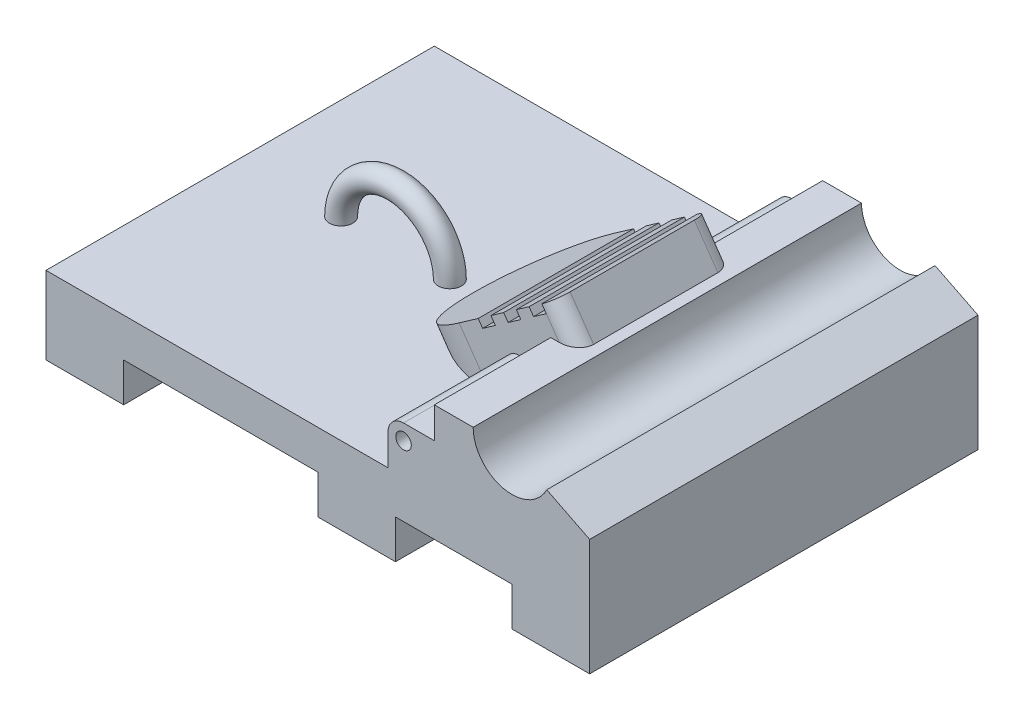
from build123d import *

# Parameters (mm, degrees)
BOSS_EXTRUDE1_DEPTH     = 63.5
FILLET1_R               = 5.08
BOSS_EXTRUDE2_REACH     = 121.09
FILLET2_R               = 5.08
SKETCH5_W               = 5.08
SKETCH5_H               = 50.8
CUT_EXTRUDE1_DEPTH      = 2.54
SWEEP1_PROFILE_R        = 3.81
BOSS_EXTRUDE3_REACH     = 175.993
SKETCH17_R              = 2.54
CUT_EXTRUDE2_DEPTH      = 174.992909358
CUT_EXTRUDE2_DEPTH_BACK = 174.992909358


with BuildPart() as part:
    # Sketch2 → Boss-Extrude1 (new, symmetric)
    with BuildSketch(Plane.XY):
        Polygon((12.7, 0), (-12.7, 0), (-12.7, 12.7), (-76.2, 12.7), (-76.2, 0), (-101.6, 0), (-101.6, 25.4), (25.4, 25.4), (25.4, 50.8), (50.8, 50.8), (76.2, 38.1), (76.2, 0), (50.8, 0), (50.8, 12.7), (12.7, 12.7), align=None)
    extrude(amount=BOSS_EXTRUDE1_DEPTH, both=True)

    # Fillet1
    fillet1_edges = [part.edges().sort_by_distance(p)[0] for p in [
        (25.4, 25.4, 0),
    ]]
    fillet(fillet1_edges, radius=FILLET1_R)

    # Sketch4 → Boss-Extrude2 (add, up to next)
    with BuildSketch(Plane(origin=(-20.290440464, 28.977752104, 0), x_dir=(0, 0, 1), z_dir=(-0.5735764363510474, 0.819152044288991, 0)), mode=Mode.PRIVATE) as boss_extrude2_sk1:
        with BuildLine():
            Line((-25.4, 19.162379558), (-25.4, 57.262379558))
            Line((-25.4, 57.262379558), (25.4, 57.262379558))
            Line((25.4, 57.262379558), (25.4, 19.162379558))
            ThreePointArc((25.4, 19.162379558), (0, -6.237620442), (-25.4, 19.162379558))
        make_face()
    boss_extrude2_tool1 = extrude(boss_extrude2_sk1.sketch, amount=-BOSS_EXTRUDE2_REACH, mode=Mode.PRIVATE) - part.part
    add(boss_extrude2_tool1.solids().sort_by_distance((2.613864, 45.015518, 0))[0])

    # Fillet2
    fillet2_edges = [part.edges().sort_by_distance(p)[0] for p in [
        (30.475034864, 56.311051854, 25.4),
        (30.475034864, 56.311051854, -25.4),
    ]]
    fillet(fillet2_edges, radius=FILLET2_R)

    # Sketch5 → Cut-Extrude1 (cut)
    with BuildSketch(Plane(origin=(-20.290440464, 28.977752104, 0), x_dir=(0.8191520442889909, 0.5735764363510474, 0), z_dir=(-0.5735764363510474, 0.8191520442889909, 0))):
        with Locations((49.642379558, 0)):
            Rectangle(SKETCH5_W, SKETCH5_H)
        with Locations((39.482379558, 0)):
            Rectangle(SKETCH5_W, SKETCH5_H)
        with Locations((29.322379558, 0)):
            Rectangle(SKETCH5_W, SKETCH5_H)
    extrude(amount=-CUT_EXTRUDE1_DEPTH, mode=Mode.SUBTRACT)

    # Sweep1: sweep along a path in Sketch6
    with BuildLine(Plane.XY) as sweep1_path:
        ThreePointArc((-68.58, 25.4), (-50.8, 43.18), (-33.02, 25.4))
    # Sweep1 profile (on start of the path) → Sweep1 (sweep)
    with BuildSketch(Plane(origin=(-68.58, 25.4, 0), x_dir=(1, 0, 0), z_dir=(0, 1, 0))):
        Circle(SWEEP1_PROFILE_R)
    sweep(path=sweep1_path.line)

    # Boss-Extrude3: up to this face of the body (flat: up to its plane)
    boss_extrude3_end = Plane(part.part.faces().sort_by_distance((4.102184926, 20.860302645, -63.5))[0])
    # Sketch17 → Boss-Extrude3 (add, up to the picked face)
    with BuildSketch(Plane.XY.offset(63.5), mode=Mode.PRIVATE) as boss_extrude3_sk1:
        with BuildLine():
            Line((20.32, 25.4), (10.245564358, 25.4))
            Line((10.245564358, 25.4), (10.245564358, 35.56))
            ThreePointArc((10.245564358, 35.56), (11.733461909, 39.152102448), (15.325564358, 40.64))
            Line((15.325564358, 40.64), (25.4, 40.64))
            Line((25.4, 40.64), (25.4, 30.48))
            ThreePointArc((25.4, 30.48), (23.912102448, 26.887897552), (20.32, 25.4))
        make_face()
        with Locations(Location((15.325564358, 35.56, 0), (0, 0, 180))):
            Circle(SKETCH17_R, mode=Mode.SUBTRACT)
    boss_extrude3_tool1 = split(extrude(boss_extrude3_sk1.sketch, amount=-BOSS_EXTRUDE3_REACH, mode=Mode.PRIVATE), bisect_by=boss_extrude3_end, keep=Keep.BOTH, mode=Mode.PRIVATE)
    add(boss_extrude3_tool1.solids().sort_by(Axis((18.07635, 32.762089, 63.5), (0, 0, -1)))[0])

    # Sketch20 → Cut-Extrude2 (cut, two sides: drawn at the far end of the back side and taken through both)
    with BuildSketch(Plane.XY.offset(63.5).offset(-CUT_EXTRUDE2_DEPTH_BACK)):
        with BuildLine():
            Line((38.1, 400.523023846), (38.1, 50.8))
            ThreePointArc((38.1, 50.8), (47.882137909, 38.439737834), (62.159225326, 45.120387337))
            Line((62.159225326, 45.120387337), (218.560116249, 357.922169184))
            Line((218.560116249, 357.922169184), (379.259888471, 1038.657328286))
            Line((379.259888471, 1038.657328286), (198.799772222, 1081.258182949))
            Line((198.799772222, 1081.258182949), (38.1, 400.523023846))
        make_face()
    extrude(amount=CUT_EXTRUDE2_DEPTH + CUT_EXTRUDE2_DEPTH_BACK, mode=Mode.SUBTRACT)


solid = part.part
